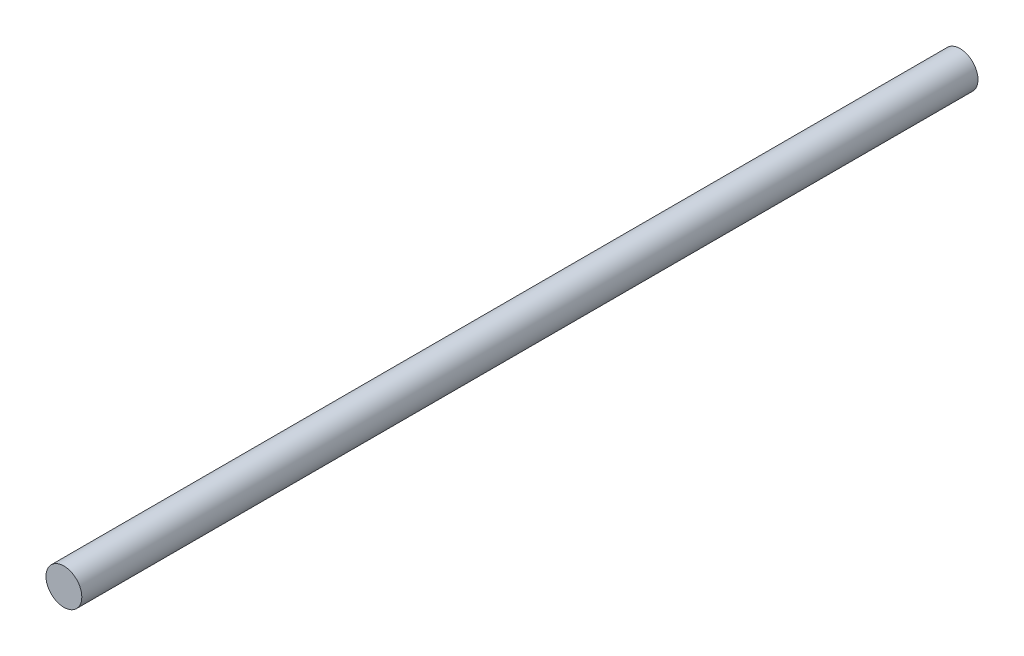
from build123d import *

# Parameters (mm, degrees)
SCHIZZO1_R        = 4
ESTRUSIONE1_DEPTH = 200


with BuildPart() as part:
    # Schizzo1 → Estrusione1 (new body)
    with BuildSketch(Plane.XY):
        Circle(SCHIZZO1_R)
    extrude(amount=-ESTRUSIONE1_DEPTH)


solid = part.part
